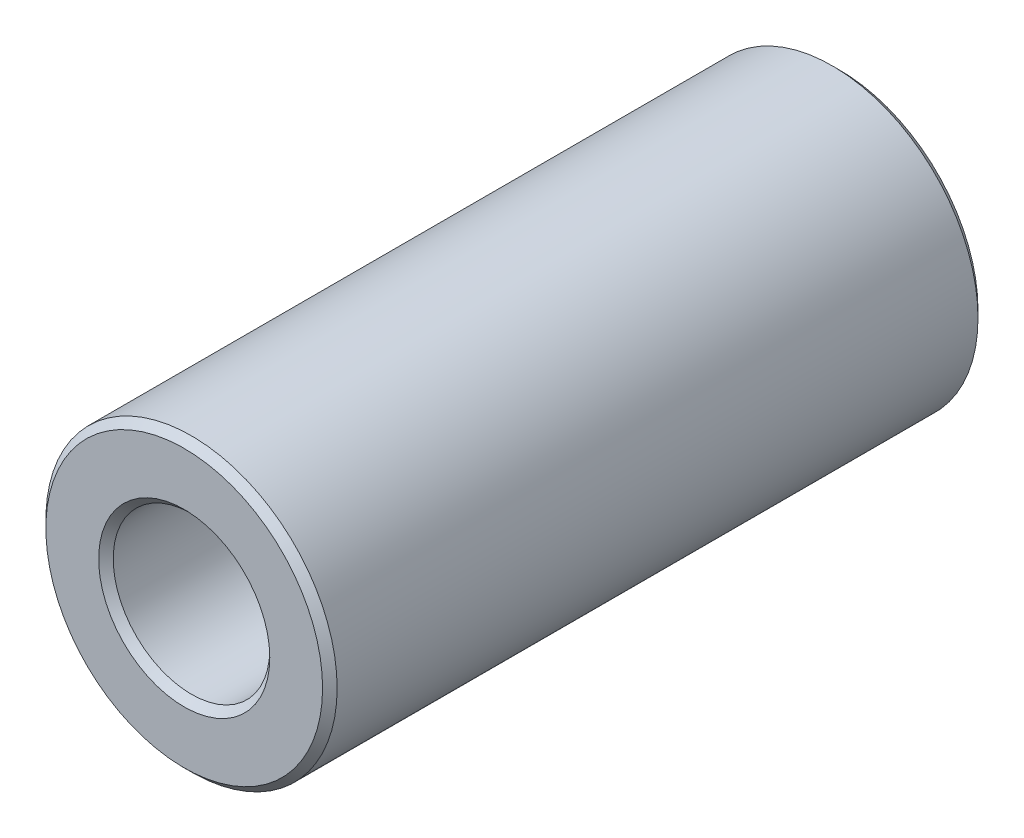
ISO-10303-21;
HEADER;
FILE_DESCRIPTION(('STEP AP214'),'2;1');
FILE_NAME('part.step','',(''),(''),'','','');
FILE_SCHEMA(('AUTOMOTIVE_DESIGN { 1 0 10303 214 1 1 1 1 }'));
ENDSEC;
DATA;
#1=APPLICATION_CONTEXT('core data for automotive mechanical design processes');
#2=APPLICATION_PROTOCOL_DEFINITION('international standard','automotive_design',2000,#1);
#3=PRODUCT_CONTEXT('',#1,'mechanical');
#4=PRODUCT('Part','Part','',(#3));
#5=PRODUCT_RELATED_PRODUCT_CATEGORY('part','',(#4));
#6=PRODUCT_DEFINITION_FORMATION('','',#4);
#7=PRODUCT_DEFINITION_CONTEXT('part definition',#1,'design');
#8=PRODUCT_DEFINITION('design','',#6,#7);
#9=PRODUCT_DEFINITION_SHAPE('','',#8);
#10=(LENGTH_UNIT() NAMED_UNIT(*) SI_UNIT(.MILLI.,.METRE.));
#11=(NAMED_UNIT(*) PLANE_ANGLE_UNIT() SI_UNIT($,.RADIAN.));
#12=(NAMED_UNIT(*) SI_UNIT($,.STERADIAN.) SOLID_ANGLE_UNIT());
#13=UNCERTAINTY_MEASURE_WITH_UNIT(LENGTH_MEASURE(1.E-05),#10,'distance_accuracy_value','');
#14=(GEOMETRIC_REPRESENTATION_CONTEXT(3) GLOBAL_UNCERTAINTY_ASSIGNED_CONTEXT((#13)) GLOBAL_UNIT_ASSIGNED_CONTEXT((#10,
#11,#12)) REPRESENTATION_CONTEXT('',''));
#15=CARTESIAN_POINT('',(0.,0.,0.));
#16=DIRECTION('',(0.,0.,1.));
#17=DIRECTION('',(1.,0.,0.));
#18=AXIS2_PLACEMENT_3D('',#15,#16,#17);
#19=CARTESIAN_POINT('',(0.,0.,9.));
#20=DIRECTION('',(0.,0.,1.));
#21=DIRECTION('',(1.,0.,0.));
#22=AXIS2_PLACEMENT_3D('',#19,#20,#21);
#23=PLANE('',#22);
#24=CARTESIAN_POINT('',(0.,0.,9.));
#25=DIRECTION('',(0.,0.,1.));
#26=DIRECTION('',(1.,0.,0.));
#27=AXIS2_PLACEMENT_3D('',#24,#25,#26);
#28=CIRCLE('',#27,2.35);
#29=CARTESIAN_POINT('',(2.35,0.,9.));
#30=VERTEX_POINT('',#29);
#31=EDGE_CURVE('E10',#30,#30,#28,.F.);
#32=ORIENTED_EDGE('',*,*,#31,.T.);
#33=EDGE_LOOP('',(#32));
#34=FACE_BOUND('',#33,.T.);
#35=CARTESIAN_POINT('',(0.,0.,9.));
#36=DIRECTION('',(0.,0.,1.));
#37=DIRECTION('',(1.,0.,0.));
#38=AXIS2_PLACEMENT_3D('',#35,#36,#37);
#39=CIRCLE('',#38,3.8);
#40=CARTESIAN_POINT('',(3.8,0.,9.));
#41=VERTEX_POINT('',#40);
#42=EDGE_CURVE('E45',#41,#41,#39,.T.);
#43=ORIENTED_EDGE('',*,*,#42,.T.);
#44=EDGE_LOOP('',(#43));
#45=FACE_BOUND('',#44,.T.);
#46=ADVANCED_FACE('F37',(#34,#45),#23,.T.);
#47=CARTESIAN_POINT('',(0.,0.,-9.));
#48=DIRECTION('',(0.,0.,1.));
#49=DIRECTION('',(1.,0.,0.));
#50=AXIS2_PLACEMENT_3D('',#47,#48,#49);
#51=PLANE('',#50);
#52=CARTESIAN_POINT('',(0.,0.,-9.));
#53=DIRECTION('',(0.,0.,1.));
#54=DIRECTION('',(1.,0.,0.));
#55=AXIS2_PLACEMENT_3D('',#52,#53,#54);
#56=CIRCLE('',#55,3.79999999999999);
#57=CARTESIAN_POINT('',(3.79999999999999,0.,-9.));
#58=VERTEX_POINT('',#57);
#59=EDGE_CURVE('E62',#58,#58,#56,.F.);
#60=ORIENTED_EDGE('',*,*,#59,.T.);
#61=EDGE_LOOP('',(#60));
#62=FACE_BOUND('',#61,.T.);
#63=CARTESIAN_POINT('',(0.,0.,-9.));
#64=DIRECTION('',(0.,0.,1.));
#65=DIRECTION('',(1.,0.,0.));
#66=AXIS2_PLACEMENT_3D('',#63,#64,#65);
#67=CIRCLE('',#66,2.35);
#68=CARTESIAN_POINT('',(2.35,0.,-9.));
#69=VERTEX_POINT('',#68);
#70=EDGE_CURVE('E66',#69,#69,#67,.T.);
#71=ORIENTED_EDGE('',*,*,#70,.T.);
#72=EDGE_LOOP('',(#71));
#73=FACE_BOUND('',#72,.T.);
#74=ADVANCED_FACE('F89',(#62,#73),#51,.F.);
#75=CARTESIAN_POINT('',(0.,0.,9.));
#76=DIRECTION('',(0.,0.,-1.));
#77=DIRECTION('',(-1.,0.,0.));
#78=AXIS2_PLACEMENT_3D('',#75,#76,#77);
#79=CYLINDRICAL_SURFACE('',#78,4.);
#80=CARTESIAN_POINT('',(0.,0.,-8.79999999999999));
#81=DIRECTION('',(0.,0.,1.));
#82=DIRECTION('',(1.,0.,0.));
#83=AXIS2_PLACEMENT_3D('',#80,#81,#82);
#84=CIRCLE('',#83,4.);
#85=CARTESIAN_POINT('',(4.,0.,-8.79999999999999));
#86=VERTEX_POINT('',#85);
#87=EDGE_CURVE('E70',#86,#86,#84,.T.);
#88=ORIENTED_EDGE('',*,*,#87,.T.);
#89=EDGE_LOOP('',(#88));
#90=FACE_BOUND('',#89,.T.);
#91=CARTESIAN_POINT('',(0.,0.,8.8));
#92=DIRECTION('',(0.,0.,1.));
#93=DIRECTION('',(1.,0.,0.));
#94=AXIS2_PLACEMENT_3D('',#91,#92,#93);
#95=CIRCLE('',#94,4.);
#96=CARTESIAN_POINT('',(4.,0.,8.8));
#97=VERTEX_POINT('',#96);
#98=EDGE_CURVE('E73',#97,#97,#95,.F.);
#99=ORIENTED_EDGE('',*,*,#98,.T.);
#100=EDGE_LOOP('',(#99));
#101=FACE_BOUND('',#100,.T.);
#102=ADVANCED_FACE('F78',(#90,#101),#79,.T.);
#103=CARTESIAN_POINT('',(0.,0.,9.));
#104=DIRECTION('',(0.,0.,-1.));
#105=DIRECTION('',(-1.,0.,0.));
#106=AXIS2_PLACEMENT_3D('',#103,#104,#105);
#107=CYLINDRICAL_SURFACE('',#106,2.15);
#108=CARTESIAN_POINT('',(0.,0.,-8.8));
#109=DIRECTION('',(0.,0.,1.));
#110=DIRECTION('',(1.,0.,0.));
#111=AXIS2_PLACEMENT_3D('',#108,#109,#110);
#112=CIRCLE('',#111,2.15);
#113=CARTESIAN_POINT('',(2.15,0.,-8.8));
#114=VERTEX_POINT('',#113);
#115=EDGE_CURVE('E51',#114,#114,#112,.F.);
#116=ORIENTED_EDGE('',*,*,#115,.T.);
#117=EDGE_LOOP('',(#116));
#118=FACE_BOUND('',#117,.T.);
#119=CARTESIAN_POINT('',(0.,0.,8.8));
#120=DIRECTION('',(0.,0.,1.));
#121=DIRECTION('',(1.,0.,0.));
#122=AXIS2_PLACEMENT_3D('',#119,#120,#121);
#123=CIRCLE('',#122,2.15);
#124=CARTESIAN_POINT('',(2.15,0.,8.8));
#125=VERTEX_POINT('',#124);
#126=EDGE_CURVE('E57',#125,#125,#123,.T.);
#127=ORIENTED_EDGE('',*,*,#126,.T.);
#128=EDGE_LOOP('',(#127));
#129=FACE_BOUND('',#128,.T.);
#130=ADVANCED_FACE('F97',(#118,#129),#107,.F.);
#131=CARTESIAN_POINT('',(0.,0.,-8.79999999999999));
#132=DIRECTION('',(0.,0.,1.));
#133=DIRECTION('',(1.,0.,0.));
#134=AXIS2_PLACEMENT_3D('',#131,#132,#133);
#135=CONICAL_SURFACE('',#134,4.,0.785398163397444);
#136=ORIENTED_EDGE('',*,*,#59,.F.);
#137=EDGE_LOOP('',(#136));
#138=FACE_BOUND('',#137,.T.);
#139=ORIENTED_EDGE('',*,*,#87,.F.);
#140=EDGE_LOOP('',(#139));
#141=FACE_BOUND('',#140,.T.);
#142=ADVANCED_FACE('F102',(#138,#141),#135,.T.);
#143=CARTESIAN_POINT('',(0.,0.,-9.));
#144=DIRECTION('',(0.,0.,-1.));
#145=DIRECTION('',(-1.,0.,0.));
#146=AXIS2_PLACEMENT_3D('',#143,#144,#145);
#147=CONICAL_SURFACE('',#146,2.35,0.785398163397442);
#148=ORIENTED_EDGE('',*,*,#115,.F.);
#149=EDGE_LOOP('',(#148));
#150=FACE_BOUND('',#149,.T.);
#151=ORIENTED_EDGE('',*,*,#70,.F.);
#152=EDGE_LOOP('',(#151));
#153=FACE_BOUND('',#152,.T.);
#154=ADVANCED_FACE('F86',(#150,#153),#147,.F.);
#155=CARTESIAN_POINT('',(0.,0.,8.8));
#156=DIRECTION('',(0.,0.,1.));
#157=DIRECTION('',(1.,0.,0.));
#158=AXIS2_PLACEMENT_3D('',#155,#156,#157);
#159=CONICAL_SURFACE('',#158,2.15,0.78539816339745);
#160=ORIENTED_EDGE('',*,*,#31,.F.);
#161=EDGE_LOOP('',(#160));
#162=FACE_BOUND('',#161,.T.);
#163=ORIENTED_EDGE('',*,*,#126,.F.);
#164=EDGE_LOOP('',(#163));
#165=FACE_BOUND('',#164,.T.);
#166=ADVANCED_FACE('F82',(#162,#165),#159,.F.);
#167=CARTESIAN_POINT('',(0.,0.,9.));
#168=DIRECTION('',(0.,0.,-1.));
#169=DIRECTION('',(-1.,0.,0.));
#170=AXIS2_PLACEMENT_3D('',#167,#168,#169);
#171=CONICAL_SURFACE('',#170,3.8,0.785398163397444);
#172=ORIENTED_EDGE('',*,*,#98,.F.);
#173=EDGE_LOOP('',(#172));
#174=FACE_BOUND('',#173,.T.);
#175=ORIENTED_EDGE('',*,*,#42,.F.);
#176=EDGE_LOOP('',(#175));
#177=FACE_BOUND('',#176,.T.);
#178=ADVANCED_FACE('F39',(#174,#177),#171,.T.);
#179=CLOSED_SHELL('',(#46,#74,#102,#130,#142,#154,#166,#178));
#180=MANIFOLD_SOLID_BREP('B2',#179);
#181=ADVANCED_BREP_SHAPE_REPRESENTATION('',(#18,#180),#14);
#182=SHAPE_DEFINITION_REPRESENTATION(#9,#181);
ENDSEC;
END-ISO-10303-21;
